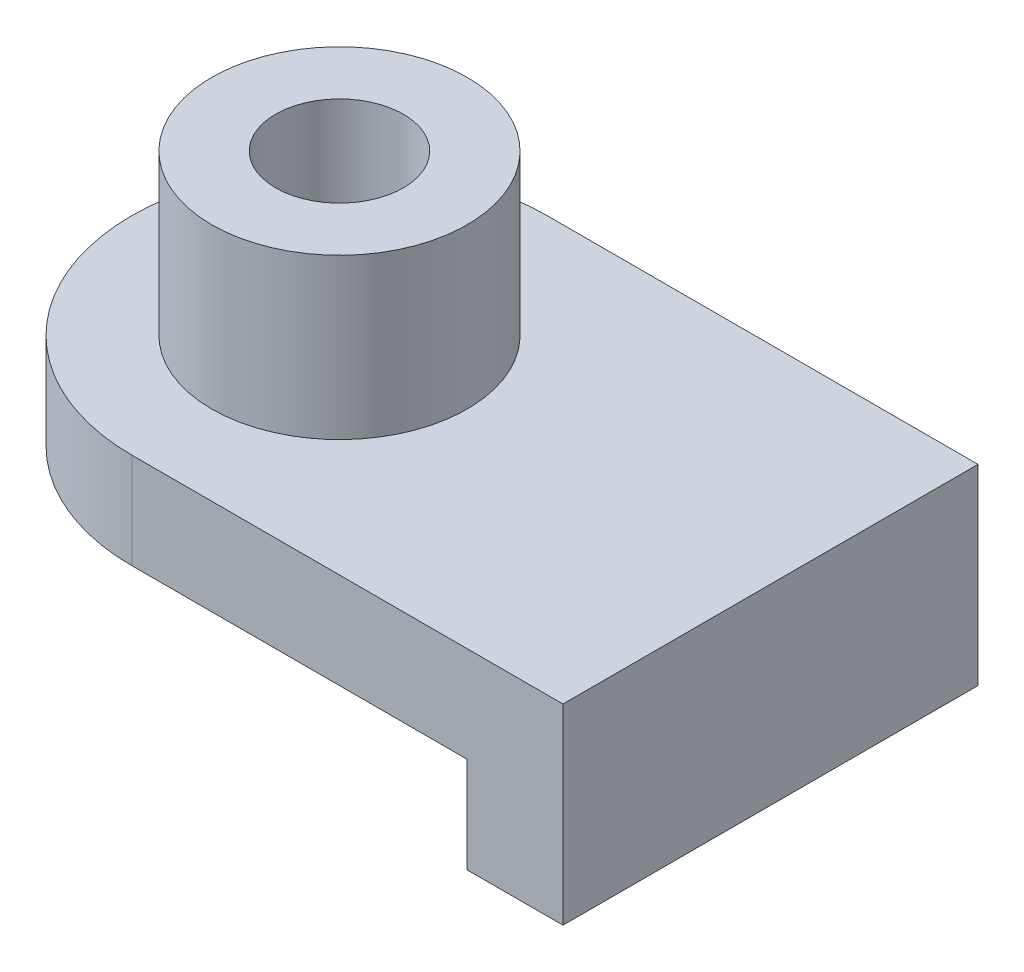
from build123d import *

# Parameters (mm, degrees)
BOSS_EXTRUDE1_DEPTH = 15
SKETCH2_W           = 15
SKETCH2_H           = 15
BOSS_EXTRUDE2_DEPTH = 65
SKETCH4_R           = 20
BOSS_EXTRUDE3_DEPTH = 25
SKETCH5_R           = 10
CUT_EXTRUDE1_DEPTH  = 132.339255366


with BuildPart() as part:
    # Sketch1 → Boss-Extrude1 (new body)
    with BuildSketch(Plane(origin=(0, 0, 0), x_dir=(1, 0, 0), z_dir=(0, 1, 0))):
        with BuildLine():
            Line((0, 0), (0, 65))
            Line((0, 65), (-67.5, 65))
            ThreePointArc((-67.5, 65), (-100, 32.5), (-67.5, 0))
            Line((-67.5, 0), (0, 0))
        make_face()
    extrude(amount=BOSS_EXTRUDE1_DEPTH)

    # Sketch2 → Boss-Extrude2 (add)
    with BuildSketch(Plane.XY):
        with Locations((-7.5, -7.5)):
            Rectangle(SKETCH2_W, SKETCH2_H)
    extrude(amount=-BOSS_EXTRUDE2_DEPTH)

    # Sketch4 → Boss-Extrude3 (add)
    with BuildSketch(Plane(origin=(0, 15, 0), x_dir=(1, 0, 0), z_dir=(0, 1, 0))):
        with Locations(Location((-67.5, 32.5, 0), (0, 0, 270))):
            Circle(SKETCH4_R)
    extrude(amount=BOSS_EXTRUDE3_DEPTH)

    # Sketch5 → Cut-Extrude1 (cut, through all)
    with BuildSketch(Plane(origin=(0, 40, 0), x_dir=(1, 0, 0), z_dir=(0, 1, 0))):
        with Locations(Location((-67.5, 32.5, 0), (0, 0, 270))):
            Circle(SKETCH5_R)
    extrude(amount=-CUT_EXTRUDE1_DEPTH, mode=Mode.SUBTRACT)


solid = part.part
